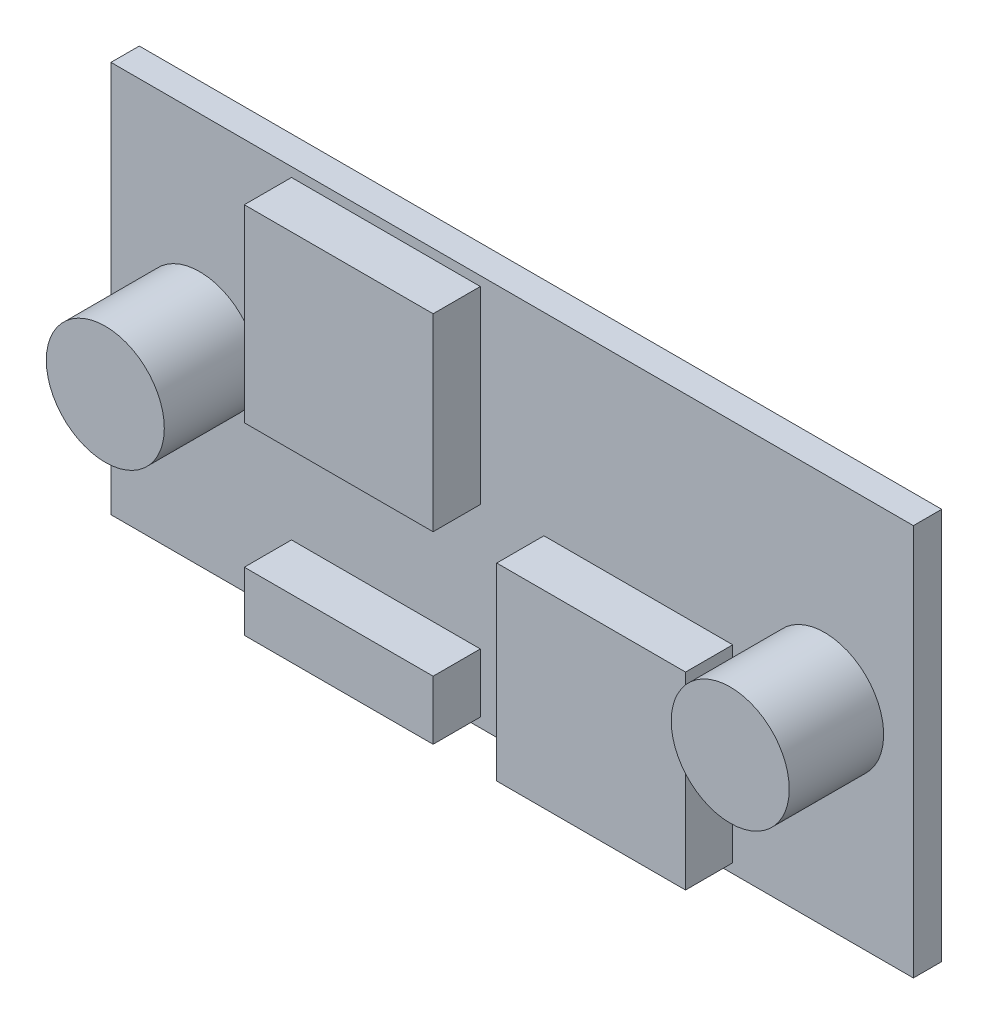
from build123d import *

# Parameters (mm, degrees)
SKETCH1_W           = 43.18
SKETCH1_H           = 21.082
BOSS_EXTRUDE1_DEPTH = 1.524
SKETCH2_R           = 3.175
SKETCH2_W           = 10.16
SKETCH2_H           = 3.175
SKETCH2_H_2         = 10.16
BOSS_EXTRUDE2_DEPTH = 2.54
SKETCH3_R           = 3.175
BOSS_EXTRUDE3_DEPTH = 2.54


with BuildPart() as part:
    # Sketch1 → Boss-Extrude1 (new body)
    with BuildSketch(Plane.XY):
        with Locations((21.59, 10.541)):
            Rectangle(SKETCH1_W, SKETCH1_H)
    extrude(amount=BOSS_EXTRUDE1_DEPTH)

    # Sketch2 → Boss-Extrude2 (add)
    with BuildSketch(Plane.XY.offset(1.524)):
        with Locations(Location((4.7752, 10.541, 0), (0, 0, 180))):
            Circle(SKETCH2_R)
        with Locations(Location((38.4048, 10.541, 0), (0, 0, 180))):
            Circle(SKETCH2_R)
        with Locations((14.79539849, 2.0955)):
            Rectangle(SKETCH2_W, SKETCH2_H)
        with Locations((28.378890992, 5.588)):
            Rectangle(SKETCH2_W, SKETCH2_H_2)
        with Locations((14.79539849, 15.494)):
            Rectangle(SKETCH2_W, SKETCH2_H_2)
    extrude(amount=BOSS_EXTRUDE2_DEPTH)

    # Sketch3 → Boss-Extrude3 (add)
    with BuildSketch(Plane.XY.offset(4.064)):
        with Locations(Location((4.7752, 10.541, 0), (0, 0, 180))):
            Circle(SKETCH3_R)
        with Locations(Location((38.4048, 10.541, 0), (0, 0, 180))):
            Circle(SKETCH3_R)
    extrude(amount=BOSS_EXTRUDE3_DEPTH)


solid = part.part
